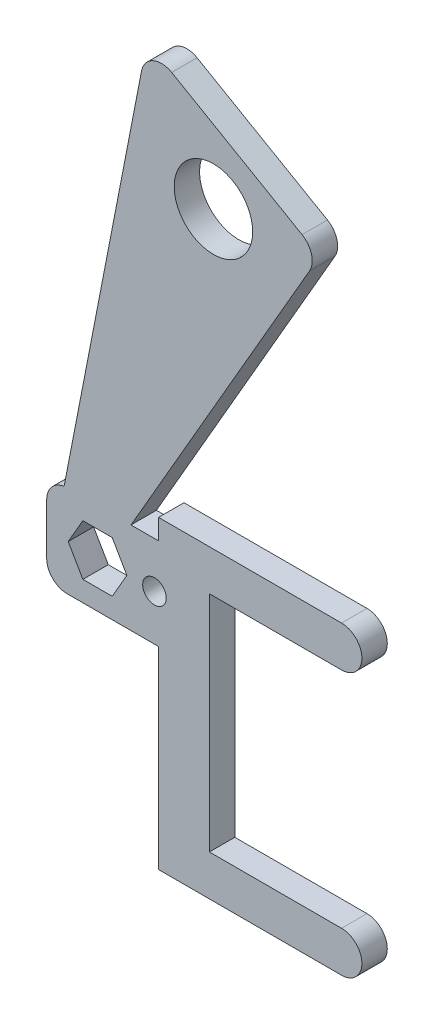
ISO-10303-21;
HEADER;
FILE_DESCRIPTION(('STEP AP214'),'2;1');
FILE_NAME('part.step','',(''),(''),'','','');
FILE_SCHEMA(('AUTOMOTIVE_DESIGN { 1 0 10303 214 1 1 1 1 }'));
ENDSEC;
DATA;
#1=APPLICATION_CONTEXT('core data for automotive mechanical design processes');
#2=APPLICATION_PROTOCOL_DEFINITION('international standard','automotive_design',2000,#1);
#3=PRODUCT_CONTEXT('',#1,'mechanical');
#4=PRODUCT('Part','Part','',(#3));
#5=PRODUCT_RELATED_PRODUCT_CATEGORY('part','',(#4));
#6=PRODUCT_DEFINITION_FORMATION('','',#4);
#7=PRODUCT_DEFINITION_CONTEXT('part definition',#1,'design');
#8=PRODUCT_DEFINITION('design','',#6,#7);
#9=PRODUCT_DEFINITION_SHAPE('','',#8);
#10=(LENGTH_UNIT() NAMED_UNIT(*) SI_UNIT(.MILLI.,.METRE.));
#11=(NAMED_UNIT(*) PLANE_ANGLE_UNIT() SI_UNIT($,.RADIAN.));
#12=(NAMED_UNIT(*) SI_UNIT($,.STERADIAN.) SOLID_ANGLE_UNIT());
#13=UNCERTAINTY_MEASURE_WITH_UNIT(LENGTH_MEASURE(1.E-05),#10,'distance_accuracy_value','');
#14=(GEOMETRIC_REPRESENTATION_CONTEXT(3) GLOBAL_UNCERTAINTY_ASSIGNED_CONTEXT((#13)) GLOBAL_UNIT_ASSIGNED_CONTEXT((#10,
#11,#12)) REPRESENTATION_CONTEXT('',''));
#15=CARTESIAN_POINT('',(0.,0.,0.));
#16=DIRECTION('',(0.,0.,1.));
#17=DIRECTION('',(1.,0.,0.));
#18=AXIS2_PLACEMENT_3D('',#15,#16,#17);
#19=CARTESIAN_POINT('',(0.,11.43,3.175));
#20=DIRECTION('',(0.,-1.,0.));
#21=DIRECTION('',(0.,0.,-1.));
#22=AXIS2_PLACEMENT_3D('',#19,#20,#21);
#23=PLANE('',#22);
#24=DIRECTION('',(0.,0.,-1.));
#25=VECTOR('',#24,1.);
#26=CARTESIAN_POINT('',(10.5271663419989,11.43,3.175));
#27=LINE('',#26,#25);
#28=CARTESIAN_POINT('',(10.5271663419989,11.43,3.175));
#29=VERTEX_POINT('',#28);
#30=CARTESIAN_POINT('',(10.5271663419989,11.43,0.));
#31=VERTEX_POINT('',#30);
#32=EDGE_CURVE('E280',#29,#31,#27,.T.);
#33=ORIENTED_EDGE('',*,*,#32,.F.);
#34=DIRECTION('',(-1.,0.,0.));
#35=VECTOR('',#34,1.);
#36=CARTESIAN_POINT('',(0.,11.43,3.175));
#37=LINE('',#36,#35);
#38=CARTESIAN_POINT('',(13.97,11.43,3.175));
#39=VERTEX_POINT('',#38);
#40=EDGE_CURVE('E297',#39,#29,#37,.T.);
#41=ORIENTED_EDGE('',*,*,#40,.F.);
#42=DIRECTION('',(0.,0.,-1.));
#43=VECTOR('',#42,1.);
#44=CARTESIAN_POINT('',(13.97,11.43,3.175));
#45=LINE('',#44,#43);
#46=CARTESIAN_POINT('',(13.97,11.43,0.));
#47=VERTEX_POINT('',#46);
#48=EDGE_CURVE('E371',#39,#47,#45,.T.);
#49=ORIENTED_EDGE('',*,*,#48,.T.);
#50=DIRECTION('',(-1.,0.,0.));
#51=VECTOR('',#50,1.);
#52=CARTESIAN_POINT('',(0.,11.43,0.));
#53=LINE('',#52,#51);
#54=EDGE_CURVE('E324',#47,#31,#53,.T.);
#55=ORIENTED_EDGE('',*,*,#54,.T.);
#56=EDGE_LOOP('',(#33,#41,#49,#55));
#57=FACE_BOUND('',#56,.T.);
#58=ADVANCED_FACE('F33',(#57),#23,.F.);
#59=CARTESIAN_POINT('',(13.97,11.43,3.175));
#60=DIRECTION('',(1.,0.,0.));
#61=DIRECTION('',(0.,0.,-1.));
#62=AXIS2_PLACEMENT_3D('',#59,#60,#61);
#63=PLANE('',#62);
#64=DIRECTION('',(0.,-1.,0.));
#65=VECTOR('',#64,1.);
#66=CARTESIAN_POINT('',(13.97,11.43,0.));
#67=LINE('',#66,#65);
#68=CARTESIAN_POINT('',(13.97,13.97,0.));
#69=VERTEX_POINT('',#68);
#70=EDGE_CURVE('E293',#69,#47,#67,.T.);
#71=ORIENTED_EDGE('',*,*,#70,.T.);
#72=ORIENTED_EDGE('',*,*,#48,.F.);
#73=DIRECTION('',(0.,-1.,0.));
#74=VECTOR('',#73,1.);
#75=CARTESIAN_POINT('',(13.97,11.43,3.175));
#76=LINE('',#75,#74);
#77=CARTESIAN_POINT('',(13.97,13.97,3.175));
#78=VERTEX_POINT('',#77);
#79=EDGE_CURVE('E294',#78,#39,#76,.T.);
#80=ORIENTED_EDGE('',*,*,#79,.F.);
#81=DIRECTION('',(0.,0.,-1.));
#82=VECTOR('',#81,1.);
#83=CARTESIAN_POINT('',(13.97,13.97,3.175));
#84=LINE('',#83,#82);
#85=EDGE_CURVE('E321',#78,#69,#84,.T.);
#86=ORIENTED_EDGE('',*,*,#85,.T.);
#87=EDGE_LOOP('',(#71,#72,#80,#86));
#88=FACE_BOUND('',#87,.T.);
#89=ADVANCED_FACE('F462',(#88),#63,.F.);
#90=CARTESIAN_POINT('',(0.,11.43,3.175));
#91=DIRECTION('',(1.,0.,0.));
#92=DIRECTION('',(0.,1.,0.));
#93=AXIS2_PLACEMENT_3D('',#90,#91,#92);
#94=PLANE('',#93);
#95=DIRECTION('',(0.,-1.,0.));
#96=VECTOR('',#95,1.);
#97=CARTESIAN_POINT('',(0.,11.43,0.));
#98=LINE('',#97,#96);
#99=CARTESIAN_POINT('',(0.,8.91667772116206,0.));
#100=VERTEX_POINT('',#99);
#101=CARTESIAN_POINT('',(0.,2.54,0.));
#102=VERTEX_POINT('',#101);
#103=EDGE_CURVE('E326',#100,#102,#98,.T.);
#104=ORIENTED_EDGE('',*,*,#103,.T.);
#105=DIRECTION('',(0.,0.,-1.));
#106=VECTOR('',#105,1.);
#107=CARTESIAN_POINT('',(0.,2.54,3.175));
#108=LINE('',#107,#106);
#109=CARTESIAN_POINT('',(0.,2.54,3.175));
#110=VERTEX_POINT('',#109);
#111=EDGE_CURVE('E48',#102,#110,#108,.F.);
#112=ORIENTED_EDGE('',*,*,#111,.T.);
#113=DIRECTION('',(0.,-1.,0.));
#114=VECTOR('',#113,1.);
#115=CARTESIAN_POINT('',(0.,11.43,3.175));
#116=LINE('',#115,#114);
#117=CARTESIAN_POINT('',(0.,8.91667772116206,3.175));
#118=VERTEX_POINT('',#117);
#119=EDGE_CURVE('E301',#118,#110,#116,.T.);
#120=ORIENTED_EDGE('',*,*,#119,.F.);
#121=DIRECTION('',(0.,0.,1.));
#122=VECTOR('',#121,1.);
#123=CARTESIAN_POINT('',(0.,8.91667772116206,3.175));
#124=LINE('',#123,#122);
#125=EDGE_CURVE('E399',#118,#100,#124,.F.);
#126=ORIENTED_EDGE('',*,*,#125,.T.);
#127=EDGE_LOOP('',(#104,#112,#120,#126));
#128=FACE_BOUND('',#127,.T.);
#129=ADVANCED_FACE('F404',(#128),#94,.F.);
#130=CARTESIAN_POINT('',(13.97,0.,3.175));
#131=DIRECTION('',(0.,1.,0.));
#132=DIRECTION('',(-1.,0.,0.));
#133=AXIS2_PLACEMENT_3D('',#130,#131,#132);
#134=PLANE('',#133);
#135=DIRECTION('',(1.,0.,0.));
#136=VECTOR('',#135,1.);
#137=CARTESIAN_POINT('',(13.97,0.,3.175));
#138=LINE('',#137,#136);
#139=CARTESIAN_POINT('',(2.54,0.,3.175));
#140=VERTEX_POINT('',#139);
#141=CARTESIAN_POINT('',(13.97,0.,3.175));
#142=VERTEX_POINT('',#141);
#143=EDGE_CURVE('E303',#140,#142,#138,.T.);
#144=ORIENTED_EDGE('',*,*,#143,.F.);
#145=DIRECTION('',(0.,0.,-1.));
#146=VECTOR('',#145,1.);
#147=CARTESIAN_POINT('',(2.54,0.,3.175));
#148=LINE('',#147,#146);
#149=CARTESIAN_POINT('',(2.54,0.,0.));
#150=VERTEX_POINT('',#149);
#151=EDGE_CURVE('E392',#140,#150,#148,.T.);
#152=ORIENTED_EDGE('',*,*,#151,.T.);
#153=DIRECTION('',(1.,0.,0.));
#154=VECTOR('',#153,1.);
#155=CARTESIAN_POINT('',(13.97,0.,0.));
#156=LINE('',#155,#154);
#157=CARTESIAN_POINT('',(13.97,0.,0.));
#158=VERTEX_POINT('',#157);
#159=EDGE_CURVE('E328',#150,#158,#156,.T.);
#160=ORIENTED_EDGE('',*,*,#159,.T.);
#161=DIRECTION('',(0.,0.,-1.));
#162=VECTOR('',#161,1.);
#163=CARTESIAN_POINT('',(13.97,0.,3.175));
#164=LINE('',#163,#162);
#165=EDGE_CURVE('E368',#142,#158,#164,.T.);
#166=ORIENTED_EDGE('',*,*,#165,.F.);
#167=EDGE_LOOP('',(#144,#152,#160,#166));
#168=FACE_BOUND('',#167,.T.);
#169=ADVANCED_FACE('F416',(#168),#134,.F.);
#170=CARTESIAN_POINT('',(13.97,-24.13,3.175));
#171=DIRECTION('',(1.,0.,0.));
#172=DIRECTION('',(0.,0.,-1.));
#173=AXIS2_PLACEMENT_3D('',#170,#171,#172);
#174=PLANE('',#173);
#175=DIRECTION('',(0.,-1.,0.));
#176=VECTOR('',#175,1.);
#177=CARTESIAN_POINT('',(13.97,-24.13,0.));
#178=LINE('',#177,#176);
#179=CARTESIAN_POINT('',(13.97,-24.13,0.));
#180=VERTEX_POINT('',#179);
#181=EDGE_CURVE('E330',#158,#180,#178,.T.);
#182=ORIENTED_EDGE('',*,*,#181,.T.);
#183=DIRECTION('',(0.,0.,-1.));
#184=VECTOR('',#183,1.);
#185=CARTESIAN_POINT('',(13.97,-24.13,3.175));
#186=LINE('',#185,#184);
#187=CARTESIAN_POINT('',(13.97,-24.13,3.175));
#188=VERTEX_POINT('',#187);
#189=EDGE_CURVE('E365',#188,#180,#186,.T.);
#190=ORIENTED_EDGE('',*,*,#189,.F.);
#191=DIRECTION('',(0.,-1.,0.));
#192=VECTOR('',#191,1.);
#193=CARTESIAN_POINT('',(13.97,-24.13,3.175));
#194=LINE('',#193,#192);
#195=EDGE_CURVE('E305',#142,#188,#194,.T.);
#196=ORIENTED_EDGE('',*,*,#195,.F.);
#197=ORIENTED_EDGE('',*,*,#165,.T.);
#198=EDGE_LOOP('',(#182,#190,#196,#197));
#199=FACE_BOUND('',#198,.T.);
#200=ADVANCED_FACE('F424',(#199),#174,.F.);
#201=CARTESIAN_POINT('',(13.97,-24.13,3.175));
#202=DIRECTION('',(0.,1.,0.));
#203=DIRECTION('',(0.,0.,1.));
#204=AXIS2_PLACEMENT_3D('',#201,#202,#203);
#205=PLANE('',#204);
#206=DIRECTION('',(1.,0.,0.));
#207=VECTOR('',#206,1.);
#208=CARTESIAN_POINT('',(13.97,-24.13,0.));
#209=LINE('',#208,#207);
#210=CARTESIAN_POINT('',(36.83,-24.13,0.));
#211=VERTEX_POINT('',#210);
#212=EDGE_CURVE('E332',#180,#211,#209,.T.);
#213=ORIENTED_EDGE('',*,*,#212,.T.);
#214=DIRECTION('',(0.,0.,-1.));
#215=VECTOR('',#214,1.);
#216=CARTESIAN_POINT('',(36.83,-24.13,3.175));
#217=LINE('',#216,#215);
#218=CARTESIAN_POINT('',(36.83,-24.13,3.175));
#219=VERTEX_POINT('',#218);
#220=EDGE_CURVE('E362',#219,#211,#217,.T.);
#221=ORIENTED_EDGE('',*,*,#220,.F.);
#222=DIRECTION('',(1.,0.,0.));
#223=VECTOR('',#222,1.);
#224=CARTESIAN_POINT('',(13.97,-24.13,3.175));
#225=LINE('',#224,#223);
#226=EDGE_CURVE('E307',#188,#219,#225,.T.);
#227=ORIENTED_EDGE('',*,*,#226,.F.);
#228=ORIENTED_EDGE('',*,*,#189,.T.);
#229=EDGE_LOOP('',(#213,#221,#227,#228));
#230=FACE_BOUND('',#229,.T.);
#231=ADVANCED_FACE('F427',(#230),#205,.F.);
#232=CARTESIAN_POINT('',(36.83,-21.59,3.175));
#233=DIRECTION('',(0.,0.,-1.));
#234=DIRECTION('',(-1.,0.,0.));
#235=AXIS2_PLACEMENT_3D('',#232,#233,#234);
#236=CYLINDRICAL_SURFACE('',#235,2.54);
#237=CARTESIAN_POINT('',(36.83,-21.59,0.));
#238=DIRECTION('',(0.,0.,1.));
#239=DIRECTION('',(-1.,0.,0.));
#240=AXIS2_PLACEMENT_3D('',#237,#238,#239);
#241=CIRCLE('',#240,2.54);
#242=CARTESIAN_POINT('',(36.83,-19.05,0.));
#243=VERTEX_POINT('',#242);
#244=EDGE_CURVE('E334',#211,#243,#241,.T.);
#245=ORIENTED_EDGE('',*,*,#244,.T.);
#246=DIRECTION('',(0.,0.,-1.));
#247=VECTOR('',#246,1.);
#248=CARTESIAN_POINT('',(36.83,-19.05,3.175));
#249=LINE('',#248,#247);
#250=CARTESIAN_POINT('',(36.83,-19.05,3.175));
#251=VERTEX_POINT('',#250);
#252=EDGE_CURVE('E359',#251,#243,#249,.T.);
#253=ORIENTED_EDGE('',*,*,#252,.F.);
#254=CARTESIAN_POINT('',(36.83,-21.59,3.175));
#255=DIRECTION('',(0.,0.,1.));
#256=DIRECTION('',(-1.,0.,0.));
#257=AXIS2_PLACEMENT_3D('',#254,#255,#256);
#258=CIRCLE('',#257,2.54);
#259=EDGE_CURVE('E309',#219,#251,#258,.T.);
#260=ORIENTED_EDGE('',*,*,#259,.F.);
#261=ORIENTED_EDGE('',*,*,#220,.T.);
#262=EDGE_LOOP('',(#245,#253,#260,#261));
#263=FACE_BOUND('',#262,.T.);
#264=ADVANCED_FACE('F432',(#263),#236,.T.);
#265=CARTESIAN_POINT('',(20.32,-19.05,3.175));
#266=DIRECTION('',(0.,-1.,0.));
#267=DIRECTION('',(0.,0.,-1.));
#268=AXIS2_PLACEMENT_3D('',#265,#266,#267);
#269=PLANE('',#268);
#270=DIRECTION('',(-1.,0.,0.));
#271=VECTOR('',#270,1.);
#272=CARTESIAN_POINT('',(20.32,-19.05,0.));
#273=LINE('',#272,#271);
#274=CARTESIAN_POINT('',(20.32,-19.05,0.));
#275=VERTEX_POINT('',#274);
#276=EDGE_CURVE('E336',#243,#275,#273,.T.);
#277=ORIENTED_EDGE('',*,*,#276,.T.);
#278=DIRECTION('',(0.,0.,-1.));
#279=VECTOR('',#278,1.);
#280=CARTESIAN_POINT('',(20.32,-19.05,3.175));
#281=LINE('',#280,#279);
#282=CARTESIAN_POINT('',(20.32,-19.05,3.175));
#283=VERTEX_POINT('',#282);
#284=EDGE_CURVE('E356',#283,#275,#281,.T.);
#285=ORIENTED_EDGE('',*,*,#284,.F.);
#286=DIRECTION('',(-1.,0.,0.));
#287=VECTOR('',#286,1.);
#288=CARTESIAN_POINT('',(20.32,-19.05,3.175));
#289=LINE('',#288,#287);
#290=EDGE_CURVE('E311',#251,#283,#289,.T.);
#291=ORIENTED_EDGE('',*,*,#290,.F.);
#292=ORIENTED_EDGE('',*,*,#252,.T.);
#293=EDGE_LOOP('',(#277,#285,#291,#292));
#294=FACE_BOUND('',#293,.T.);
#295=ADVANCED_FACE('F438',(#294),#269,.F.);
#296=CARTESIAN_POINT('',(20.32,8.89,3.175));
#297=DIRECTION('',(-1.,0.,0.));
#298=DIRECTION('',(0.,-1.,0.));
#299=AXIS2_PLACEMENT_3D('',#296,#297,#298);
#300=PLANE('',#299);
#301=DIRECTION('',(0.,1.,0.));
#302=VECTOR('',#301,1.);
#303=CARTESIAN_POINT('',(20.32,8.89,0.));
#304=LINE('',#303,#302);
#305=CARTESIAN_POINT('',(20.32,8.89,0.));
#306=VERTEX_POINT('',#305);
#307=EDGE_CURVE('E338',#275,#306,#304,.T.);
#308=ORIENTED_EDGE('',*,*,#307,.T.);
#309=DIRECTION('',(0.,0.,-1.));
#310=VECTOR('',#309,1.);
#311=CARTESIAN_POINT('',(20.32,8.89,3.175));
#312=LINE('',#311,#310);
#313=CARTESIAN_POINT('',(20.32,8.89,3.175));
#314=VERTEX_POINT('',#313);
#315=EDGE_CURVE('E353',#314,#306,#312,.T.);
#316=ORIENTED_EDGE('',*,*,#315,.F.);
#317=DIRECTION('',(0.,1.,0.));
#318=VECTOR('',#317,1.);
#319=CARTESIAN_POINT('',(20.32,8.89,3.175));
#320=LINE('',#319,#318);
#321=EDGE_CURVE('E313',#283,#314,#320,.T.);
#322=ORIENTED_EDGE('',*,*,#321,.F.);
#323=ORIENTED_EDGE('',*,*,#284,.T.);
#324=EDGE_LOOP('',(#308,#316,#322,#323));
#325=FACE_BOUND('',#324,.T.);
#326=ADVANCED_FACE('F442',(#325),#300,.F.);
#327=CARTESIAN_POINT('',(20.32,8.89,3.175));
#328=DIRECTION('',(0.,1.,0.));
#329=DIRECTION('',(0.,0.,1.));
#330=AXIS2_PLACEMENT_3D('',#327,#328,#329);
#331=PLANE('',#330);
#332=DIRECTION('',(1.,0.,0.));
#333=VECTOR('',#332,1.);
#334=CARTESIAN_POINT('',(20.32,8.89,0.));
#335=LINE('',#334,#333);
#336=CARTESIAN_POINT('',(36.83,8.89,0.));
#337=VERTEX_POINT('',#336);
#338=EDGE_CURVE('E340',#306,#337,#335,.T.);
#339=ORIENTED_EDGE('',*,*,#338,.T.);
#340=DIRECTION('',(0.,0.,-1.));
#341=VECTOR('',#340,1.);
#342=CARTESIAN_POINT('',(36.83,8.89,3.175));
#343=LINE('',#342,#341);
#344=CARTESIAN_POINT('',(36.83,8.89,3.175));
#345=VERTEX_POINT('',#344);
#346=EDGE_CURVE('E350',#345,#337,#343,.T.);
#347=ORIENTED_EDGE('',*,*,#346,.F.);
#348=DIRECTION('',(1.,0.,0.));
#349=VECTOR('',#348,1.);
#350=CARTESIAN_POINT('',(20.32,8.89,3.175));
#351=LINE('',#350,#349);
#352=EDGE_CURVE('E315',#314,#345,#351,.T.);
#353=ORIENTED_EDGE('',*,*,#352,.F.);
#354=ORIENTED_EDGE('',*,*,#315,.T.);
#355=EDGE_LOOP('',(#339,#347,#353,#354));
#356=FACE_BOUND('',#355,.T.);
#357=ADVANCED_FACE('F447',(#356),#331,.F.);
#358=CARTESIAN_POINT('',(36.83,11.43,3.175));
#359=DIRECTION('',(0.,0.,-1.));
#360=DIRECTION('',(-1.,0.,0.));
#361=AXIS2_PLACEMENT_3D('',#358,#359,#360);
#362=CYLINDRICAL_SURFACE('',#361,2.54);
#363=CARTESIAN_POINT('',(36.83,11.43,0.));
#364=DIRECTION('',(0.,0.,1.));
#365=DIRECTION('',(1.,0.,0.));
#366=AXIS2_PLACEMENT_3D('',#363,#364,#365);
#367=CIRCLE('',#366,2.54);
#368=CARTESIAN_POINT('',(36.83,13.97,0.));
#369=VERTEX_POINT('',#368);
#370=EDGE_CURVE('E342',#337,#369,#367,.T.);
#371=ORIENTED_EDGE('',*,*,#370,.T.);
#372=DIRECTION('',(0.,0.,-1.));
#373=VECTOR('',#372,1.);
#374=CARTESIAN_POINT('',(36.83,13.97,3.175));
#375=LINE('',#374,#373);
#376=CARTESIAN_POINT('',(36.83,13.97,3.175));
#377=VERTEX_POINT('',#376);
#378=EDGE_CURVE('E347',#377,#369,#375,.T.);
#379=ORIENTED_EDGE('',*,*,#378,.F.);
#380=CARTESIAN_POINT('',(36.83,11.43,3.175));
#381=DIRECTION('',(0.,0.,1.));
#382=DIRECTION('',(1.,0.,0.));
#383=AXIS2_PLACEMENT_3D('',#380,#381,#382);
#384=CIRCLE('',#383,2.54);
#385=EDGE_CURVE('E317',#345,#377,#384,.T.);
#386=ORIENTED_EDGE('',*,*,#385,.F.);
#387=ORIENTED_EDGE('',*,*,#346,.T.);
#388=EDGE_LOOP('',(#371,#379,#386,#387));
#389=FACE_BOUND('',#388,.T.);
#390=ADVANCED_FACE('F453',(#389),#362,.T.);
#391=CARTESIAN_POINT('',(36.83,13.97,3.175));
#392=DIRECTION('',(0.,-1.,0.));
#393=DIRECTION('',(1.,0.,0.));
#394=AXIS2_PLACEMENT_3D('',#391,#392,#393);
#395=PLANE('',#394);
#396=DIRECTION('',(-1.,0.,0.));
#397=VECTOR('',#396,1.);
#398=CARTESIAN_POINT('',(36.83,13.97,0.));
#399=LINE('',#398,#397);
#400=EDGE_CURVE('E298',#369,#69,#399,.T.);
#401=ORIENTED_EDGE('',*,*,#400,.T.);
#402=ORIENTED_EDGE('',*,*,#85,.F.);
#403=DIRECTION('',(-1.,0.,0.));
#404=VECTOR('',#403,1.);
#405=CARTESIAN_POINT('',(36.83,13.97,3.175));
#406=LINE('',#405,#404);
#407=EDGE_CURVE('E319',#377,#78,#406,.T.);
#408=ORIENTED_EDGE('',*,*,#407,.F.);
#409=ORIENTED_EDGE('',*,*,#378,.T.);
#410=EDGE_LOOP('',(#401,#402,#408,#409));
#411=FACE_BOUND('',#410,.T.);
#412=ADVANCED_FACE('F457',(#411),#395,.F.);
#413=CARTESIAN_POINT('',(36.83,11.43,3.175));
#414=DIRECTION('',(0.,0.,1.));
#415=DIRECTION('',(1.,0.,0.));
#416=AXIS2_PLACEMENT_3D('',#413,#414,#415);
#417=PLANE('',#416);
#418=DIRECTION('',(-0.5,0.866025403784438,0.));
#419=VECTOR('',#418,1.);
#420=CARTESIAN_POINT('',(10.0161742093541,5.715,3.175));
#421=LINE('',#420,#419);
#422=CARTESIAN_POINT('',(10.0161742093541,5.715,3.175));
#423=VERTEX_POINT('',#422);
#424=CARTESIAN_POINT('',(8.18308710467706,8.89,3.175));
#425=VERTEX_POINT('',#424);
#426=EDGE_CURVE('E206',#423,#425,#421,.T.);
#427=ORIENTED_EDGE('',*,*,#426,.F.);
#428=DIRECTION('',(0.499999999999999,0.866025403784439,0.));
#429=VECTOR('',#428,1.);
#430=CARTESIAN_POINT('',(8.18308710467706,2.54,3.175));
#431=LINE('',#430,#429);
#432=CARTESIAN_POINT('',(8.18308710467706,2.54,3.175));
#433=VERTEX_POINT('',#432);
#434=EDGE_CURVE('E225',#433,#423,#431,.T.);
#435=ORIENTED_EDGE('',*,*,#434,.F.);
#436=DIRECTION('',(1.,0.,0.));
#437=VECTOR('',#436,1.);
#438=CARTESIAN_POINT('',(4.51691289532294,2.54,3.175));
#439=LINE('',#438,#437);
#440=CARTESIAN_POINT('',(4.51691289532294,2.54,3.175));
#441=VERTEX_POINT('',#440);
#442=EDGE_CURVE('E228',#441,#433,#439,.T.);
#443=ORIENTED_EDGE('',*,*,#442,.F.);
#444=DIRECTION('',(0.5,-0.866025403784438,0.));
#445=VECTOR('',#444,1.);
#446=CARTESIAN_POINT('',(2.68382579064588,5.715,3.175));
#447=LINE('',#446,#445);
#448=CARTESIAN_POINT('',(2.68382579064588,5.715,3.175));
#449=VERTEX_POINT('',#448);
#450=EDGE_CURVE('E244',#449,#441,#447,.T.);
#451=ORIENTED_EDGE('',*,*,#450,.F.);
#452=DIRECTION('',(-0.499999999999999,-0.866025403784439,0.));
#453=VECTOR('',#452,1.);
#454=CARTESIAN_POINT('',(4.51691289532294,8.89,3.175));
#455=LINE('',#454,#453);
#456=CARTESIAN_POINT('',(4.51691289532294,8.89,3.175));
#457=VERTEX_POINT('',#456);
#458=EDGE_CURVE('E241',#457,#449,#455,.T.);
#459=ORIENTED_EDGE('',*,*,#458,.F.);
#460=DIRECTION('',(-1.,0.,0.));
#461=VECTOR('',#460,1.);
#462=CARTESIAN_POINT('',(8.18308710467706,8.89,3.175));
#463=LINE('',#462,#461);
#464=EDGE_CURVE('E239',#425,#457,#463,.T.);
#465=ORIENTED_EDGE('',*,*,#464,.F.);
#466=EDGE_LOOP('',(#427,#435,#443,#451,#459,#465));
#467=FACE_BOUND('',#466,.T.);
#468=CARTESIAN_POINT('',(20.8267595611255,50.7472689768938,3.175));
#469=DIRECTION('',(0.,0.,1.));
#470=DIRECTION('',(1.,0.,0.));
#471=AXIS2_PLACEMENT_3D('',#468,#469,#470);
#472=CIRCLE('',#471,4.90219999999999);
#473=CARTESIAN_POINT('',(25.7289595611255,50.7472689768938,3.175));
#474=VERTEX_POINT('',#473);
#475=EDGE_CURVE('E251',#474,#474,#472,.T.);
#476=ORIENTED_EDGE('',*,*,#475,.F.);
#477=EDGE_LOOP('',(#476));
#478=FACE_BOUND('',#477,.T.);
#479=CARTESIAN_POINT('',(13.462,5.715,3.175));
#480=DIRECTION('',(0.,0.,1.));
#481=DIRECTION('',(1.,0.,0.));
#482=AXIS2_PLACEMENT_3D('',#479,#480,#481);
#483=CIRCLE('',#482,1.47319999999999);
#484=CARTESIAN_POINT('',(14.9352,5.715,3.175));
#485=VERTEX_POINT('',#484);
#486=EDGE_CURVE('E264',#485,#485,#483,.T.);
#487=ORIENTED_EDGE('',*,*,#486,.F.);
#488=EDGE_LOOP('',(#487));
#489=FACE_BOUND('',#488,.T.);
#490=ORIENTED_EDGE('',*,*,#119,.T.);
#491=CARTESIAN_POINT('',(2.54,2.54,3.175));
#492=DIRECTION('',(0.,0.,1.));
#493=DIRECTION('',(1.,0.,0.));
#494=AXIS2_PLACEMENT_3D('',#491,#492,#493);
#495=CIRCLE('',#494,2.54);
#496=EDGE_CURVE('E11',#110,#140,#495,.T.);
#497=ORIENTED_EDGE('',*,*,#496,.T.);
#498=ORIENTED_EDGE('',*,*,#143,.T.);
#499=ORIENTED_EDGE('',*,*,#195,.T.);
#500=ORIENTED_EDGE('',*,*,#226,.T.);
#501=ORIENTED_EDGE('',*,*,#259,.T.);
#502=ORIENTED_EDGE('',*,*,#290,.T.);
#503=ORIENTED_EDGE('',*,*,#321,.T.);
#504=ORIENTED_EDGE('',*,*,#352,.T.);
#505=ORIENTED_EDGE('',*,*,#385,.T.);
#506=ORIENTED_EDGE('',*,*,#407,.T.);
#507=ORIENTED_EDGE('',*,*,#79,.T.);
#508=ORIENTED_EDGE('',*,*,#40,.T.);
#509=DIRECTION('',(0.499999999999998,0.86602540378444,0.));
#510=VECTOR('',#509,1.);
#511=CARTESIAN_POINT('',(10.5271663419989,11.43,3.175));
#512=LINE('',#511,#510);
#513=CARTESIAN_POINT('',(32.8256915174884,50.0521785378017,3.175));
#514=VERTEX_POINT('',#513);
#515=EDGE_CURVE('E273',#29,#514,#512,.T.);
#516=ORIENTED_EDGE('',*,*,#515,.T.);
#517=CARTESIAN_POINT('',(30.6259869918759,51.3221785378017,3.175));
#518=DIRECTION('',(0.,0.,1.));
#519=DIRECTION('',(1.,0.,0.));
#520=AXIS2_PLACEMENT_3D('',#517,#518,#519);
#521=CIRCLE('',#520,2.54);
#522=CARTESIAN_POINT('',(31.8959869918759,53.5218830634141,3.175));
#523=VERTEX_POINT('',#522);
#524=EDGE_CURVE('E387',#514,#523,#521,.T.);
#525=ORIENTED_EDGE('',*,*,#524,.T.);
#526=DIRECTION('',(-0.866025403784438,0.500000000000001,0.));
#527=VECTOR('',#526,1.);
#528=CARTESIAN_POINT('',(12.5282242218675,64.7038661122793,3.175));
#529=LINE('',#528,#527);
#530=CARTESIAN_POINT('',(15.6120962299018,62.9233917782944,3.175));
#531=VERTEX_POINT('',#530);
#532=EDGE_CURVE('E277',#523,#531,#529,.T.);
#533=ORIENTED_EDGE('',*,*,#532,.T.);
#534=CARTESIAN_POINT('',(14.3420962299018,60.7236872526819,3.175));
#535=DIRECTION('',(0.,0.,1.));
#536=DIRECTION('',(1.,0.,0.));
#537=AXIS2_PLACEMENT_3D('',#534,#535,#536);
#538=CIRCLE('',#537,2.54);
#539=CARTESIAN_POINT('',(11.8487631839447,61.2083421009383,3.175));
#540=VERTEX_POINT('',#539);
#541=EDGE_CURVE('E385',#531,#540,#538,.T.);
#542=ORIENTED_EDGE('',*,*,#541,.T.);
#543=DIRECTION('',(-0.190808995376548,-0.981627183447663,0.));
#544=VECTOR('',#543,1.);
#545=CARTESIAN_POINT('',(2.17283365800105,11.43,3.175));
#546=LINE('',#545,#544);
#547=CARTESIAN_POINT('',(2.17283365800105,11.43,3.175));
#548=VERTEX_POINT('',#547);
#549=EDGE_CURVE('E271',#540,#548,#546,.T.);
#550=ORIENTED_EDGE('',*,*,#549,.T.);
#551=CARTESIAN_POINT('',(2.54,8.91667772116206,3.175));
#552=DIRECTION('',(0.,0.,1.));
#553=DIRECTION('',(1.,0.,0.));
#554=AXIS2_PLACEMENT_3D('',#551,#552,#553);
#555=CIRCLE('',#554,2.54);
#556=EDGE_CURVE('E41',#548,#118,#555,.T.);
#557=ORIENTED_EDGE('',*,*,#556,.T.);
#558=EDGE_LOOP('',(#490,#497,#498,#499,#500,#501,#502,#503,#504,#505,#506,#507,#508,#516,#525,
#533,#542,#550,#557));
#559=FACE_BOUND('',#558,.T.);
#560=ADVANCED_FACE('F419',(#467,#478,#489,#559),#417,.T.);
#561=CARTESIAN_POINT('',(36.83,11.43,0.));
#562=DIRECTION('',(0.,0.,1.));
#563=DIRECTION('',(1.,0.,0.));
#564=AXIS2_PLACEMENT_3D('',#561,#562,#563);
#565=PLANE('',#564);
#566=DIRECTION('',(0.499999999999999,0.866025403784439,0.));
#567=VECTOR('',#566,1.);
#568=CARTESIAN_POINT('',(8.18308710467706,2.54,0.));
#569=LINE('',#568,#567);
#570=CARTESIAN_POINT('',(8.18308710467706,2.54,0.));
#571=VERTEX_POINT('',#570);
#572=CARTESIAN_POINT('',(10.0161742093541,5.715,0.));
#573=VERTEX_POINT('',#572);
#574=EDGE_CURVE('E211',#571,#573,#569,.T.);
#575=ORIENTED_EDGE('',*,*,#574,.T.);
#576=DIRECTION('',(-0.5,0.866025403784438,0.));
#577=VECTOR('',#576,1.);
#578=CARTESIAN_POINT('',(10.0161742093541,5.715,0.));
#579=LINE('',#578,#577);
#580=CARTESIAN_POINT('',(8.18308710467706,8.89,0.));
#581=VERTEX_POINT('',#580);
#582=EDGE_CURVE('E203',#573,#581,#579,.T.);
#583=ORIENTED_EDGE('',*,*,#582,.T.);
#584=DIRECTION('',(-1.,0.,0.));
#585=VECTOR('',#584,1.);
#586=CARTESIAN_POINT('',(8.18308710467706,8.89,0.));
#587=LINE('',#586,#585);
#588=CARTESIAN_POINT('',(4.51691289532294,8.89,0.));
#589=VERTEX_POINT('',#588);
#590=EDGE_CURVE('E215',#581,#589,#587,.T.);
#591=ORIENTED_EDGE('',*,*,#590,.T.);
#592=DIRECTION('',(-0.499999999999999,-0.866025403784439,0.));
#593=VECTOR('',#592,1.);
#594=CARTESIAN_POINT('',(4.51691289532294,8.89,0.));
#595=LINE('',#594,#593);
#596=CARTESIAN_POINT('',(2.68382579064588,5.715,0.));
#597=VERTEX_POINT('',#596);
#598=EDGE_CURVE('E219',#589,#597,#595,.T.);
#599=ORIENTED_EDGE('',*,*,#598,.T.);
#600=DIRECTION('',(0.5,-0.866025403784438,0.));
#601=VECTOR('',#600,1.);
#602=CARTESIAN_POINT('',(2.68382579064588,5.715,0.));
#603=LINE('',#602,#601);
#604=CARTESIAN_POINT('',(4.51691289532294,2.54,0.));
#605=VERTEX_POINT('',#604);
#606=EDGE_CURVE('E232',#597,#605,#603,.T.);
#607=ORIENTED_EDGE('',*,*,#606,.T.);
#608=DIRECTION('',(1.,0.,0.));
#609=VECTOR('',#608,1.);
#610=CARTESIAN_POINT('',(4.51691289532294,2.54,0.));
#611=LINE('',#610,#609);
#612=EDGE_CURVE('E235',#605,#571,#611,.T.);
#613=ORIENTED_EDGE('',*,*,#612,.T.);
#614=EDGE_LOOP('',(#575,#583,#591,#599,#607,#613));
#615=FACE_BOUND('',#614,.T.);
#616=CARTESIAN_POINT('',(20.8267595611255,50.7472689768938,0.));
#617=DIRECTION('',(0.,0.,1.));
#618=DIRECTION('',(1.,0.,0.));
#619=AXIS2_PLACEMENT_3D('',#616,#617,#618);
#620=CIRCLE('',#619,4.9022);
#621=CARTESIAN_POINT('',(25.7289595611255,50.7472689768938,0.));
#622=VERTEX_POINT('',#621);
#623=EDGE_CURVE('E261',#622,#622,#620,.T.);
#624=ORIENTED_EDGE('',*,*,#623,.T.);
#625=EDGE_LOOP('',(#624));
#626=FACE_BOUND('',#625,.T.);
#627=CARTESIAN_POINT('',(13.462,5.715,0.));
#628=DIRECTION('',(0.,0.,1.));
#629=DIRECTION('',(1.,0.,0.));
#630=AXIS2_PLACEMENT_3D('',#627,#628,#629);
#631=CIRCLE('',#630,1.4732);
#632=CARTESIAN_POINT('',(14.9352,5.715,0.));
#633=VERTEX_POINT('',#632);
#634=EDGE_CURVE('E267',#633,#633,#631,.T.);
#635=ORIENTED_EDGE('',*,*,#634,.T.);
#636=EDGE_LOOP('',(#635));
#637=FACE_BOUND('',#636,.T.);
#638=ORIENTED_EDGE('',*,*,#159,.F.);
#639=CARTESIAN_POINT('',(2.54,2.54,0.));
#640=DIRECTION('',(0.,0.,1.));
#641=DIRECTION('',(1.,0.,0.));
#642=AXIS2_PLACEMENT_3D('',#639,#640,#641);
#643=CIRCLE('',#642,2.54);
#644=EDGE_CURVE('E397',#150,#102,#643,.F.);
#645=ORIENTED_EDGE('',*,*,#644,.T.);
#646=ORIENTED_EDGE('',*,*,#103,.F.);
#647=CARTESIAN_POINT('',(2.54,8.91667772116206,0.));
#648=DIRECTION('',(0.,0.,1.));
#649=DIRECTION('',(1.,0.,0.));
#650=AXIS2_PLACEMENT_3D('',#647,#648,#649);
#651=CIRCLE('',#650,2.54);
#652=CARTESIAN_POINT('',(2.17283365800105,11.43,0.));
#653=VERTEX_POINT('',#652);
#654=EDGE_CURVE('E395',#100,#653,#651,.F.);
#655=ORIENTED_EDGE('',*,*,#654,.T.);
#656=DIRECTION('',(-0.190808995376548,-0.981627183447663,0.));
#657=VECTOR('',#656,1.);
#658=CARTESIAN_POINT('',(2.17283365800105,11.43,0.));
#659=LINE('',#658,#657);
#660=CARTESIAN_POINT('',(11.8487631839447,61.2083421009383,0.));
#661=VERTEX_POINT('',#660);
#662=EDGE_CURVE('E270',#661,#653,#659,.T.);
#663=ORIENTED_EDGE('',*,*,#662,.F.);
#664=CARTESIAN_POINT('',(14.3420962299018,60.7236872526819,0.));
#665=DIRECTION('',(0.,0.,1.));
#666=DIRECTION('',(1.,0.,0.));
#667=AXIS2_PLACEMENT_3D('',#664,#665,#666);
#668=CIRCLE('',#667,2.54);
#669=CARTESIAN_POINT('',(15.6120962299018,62.9233917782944,0.));
#670=VERTEX_POINT('',#669);
#671=EDGE_CURVE('E379',#661,#670,#668,.F.);
#672=ORIENTED_EDGE('',*,*,#671,.T.);
#673=DIRECTION('',(-0.866025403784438,0.500000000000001,0.));
#674=VECTOR('',#673,1.);
#675=CARTESIAN_POINT('',(12.5282242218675,64.7038661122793,0.));
#676=LINE('',#675,#674);
#677=CARTESIAN_POINT('',(31.8959869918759,53.5218830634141,0.));
#678=VERTEX_POINT('',#677);
#679=EDGE_CURVE('E274',#678,#670,#676,.T.);
#680=ORIENTED_EDGE('',*,*,#679,.F.);
#681=CARTESIAN_POINT('',(30.6259869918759,51.3221785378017,0.));
#682=DIRECTION('',(0.,0.,1.));
#683=DIRECTION('',(1.,0.,0.));
#684=AXIS2_PLACEMENT_3D('',#681,#682,#683);
#685=CIRCLE('',#684,2.54);
#686=CARTESIAN_POINT('',(32.8256915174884,50.0521785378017,0.));
#687=VERTEX_POINT('',#686);
#688=EDGE_CURVE('E381',#678,#687,#685,.F.);
#689=ORIENTED_EDGE('',*,*,#688,.T.);
#690=DIRECTION('',(0.499999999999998,0.86602540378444,0.));
#691=VECTOR('',#690,1.);
#692=CARTESIAN_POINT('',(10.5271663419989,11.43,0.));
#693=LINE('',#692,#691);
#694=EDGE_CURVE('E283',#31,#687,#693,.T.);
#695=ORIENTED_EDGE('',*,*,#694,.F.);
#696=ORIENTED_EDGE('',*,*,#54,.F.);
#697=ORIENTED_EDGE('',*,*,#70,.F.);
#698=ORIENTED_EDGE('',*,*,#400,.F.);
#699=ORIENTED_EDGE('',*,*,#370,.F.);
#700=ORIENTED_EDGE('',*,*,#338,.F.);
#701=ORIENTED_EDGE('',*,*,#307,.F.);
#702=ORIENTED_EDGE('',*,*,#276,.F.);
#703=ORIENTED_EDGE('',*,*,#244,.F.);
#704=ORIENTED_EDGE('',*,*,#212,.F.);
#705=ORIENTED_EDGE('',*,*,#181,.F.);
#706=EDGE_LOOP('',(#638,#645,#646,#655,#663,#672,#680,#689,#695,#696,#697,#698,#699,#700,#701,
#702,#703,#704,#705));
#707=FACE_BOUND('',#706,.T.);
#708=ADVANCED_FACE('F221',(#615,#626,#637,#707),#565,.F.);
#709=CARTESIAN_POINT('',(2.17283365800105,11.43,3.175));
#710=DIRECTION('',(0.981627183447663,-0.190808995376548,0.));
#711=DIRECTION('',(0.190808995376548,0.981627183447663,0.));
#712=AXIS2_PLACEMENT_3D('',#709,#710,#711);
#713=PLANE('',#712);
#714=ORIENTED_EDGE('',*,*,#549,.F.);
#715=DIRECTION('',(0.,0.,-1.));
#716=VECTOR('',#715,1.);
#717=CARTESIAN_POINT('',(11.8487631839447,61.2083421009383,3.175));
#718=LINE('',#717,#716);
#719=EDGE_CURVE('E389',#540,#661,#718,.T.);
#720=ORIENTED_EDGE('',*,*,#719,.T.);
#721=ORIENTED_EDGE('',*,*,#662,.T.);
#722=DIRECTION('',(0.,0.,-1.));
#723=VECTOR('',#722,1.);
#724=CARTESIAN_POINT('',(2.17283365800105,11.43,3.175));
#725=LINE('',#724,#723);
#726=EDGE_CURVE('E290',#548,#653,#725,.T.);
#727=ORIENTED_EDGE('',*,*,#726,.F.);
#728=EDGE_LOOP('',(#714,#720,#721,#727));
#729=FACE_BOUND('',#728,.T.);
#730=ADVANCED_FACE('F485',(#729),#713,.F.);
#731=CARTESIAN_POINT('',(10.5271663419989,11.43,3.175));
#732=DIRECTION('',(-0.86602540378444,0.499999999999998,0.));
#733=DIRECTION('',(-0.499999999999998,-0.86602540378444,0.));
#734=AXIS2_PLACEMENT_3D('',#731,#732,#733);
#735=PLANE('',#734);
#736=ORIENTED_EDGE('',*,*,#694,.T.);
#737=DIRECTION('',(0.,0.,-1.));
#738=VECTOR('',#737,1.);
#739=CARTESIAN_POINT('',(32.8256915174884,50.0521785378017,3.175));
#740=LINE('',#739,#738);
#741=EDGE_CURVE('E383',#687,#514,#740,.F.);
#742=ORIENTED_EDGE('',*,*,#741,.T.);
#743=ORIENTED_EDGE('',*,*,#515,.F.);
#744=ORIENTED_EDGE('',*,*,#32,.T.);
#745=EDGE_LOOP('',(#736,#742,#743,#744));
#746=FACE_BOUND('',#745,.T.);
#747=ADVANCED_FACE('F467',(#746),#735,.F.);
#748=CARTESIAN_POINT('',(12.5282242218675,64.7038661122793,3.175));
#749=DIRECTION('',(-0.500000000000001,-0.866025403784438,0.));
#750=DIRECTION('',(0.866025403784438,-0.500000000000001,0.));
#751=AXIS2_PLACEMENT_3D('',#748,#749,#750);
#752=PLANE('',#751);
#753=ORIENTED_EDGE('',*,*,#532,.F.);
#754=DIRECTION('',(0.,0.,-1.));
#755=VECTOR('',#754,1.);
#756=CARTESIAN_POINT('',(31.8959869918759,53.5218830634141,3.175));
#757=LINE('',#756,#755);
#758=EDGE_CURVE('E376',#523,#678,#757,.T.);
#759=ORIENTED_EDGE('',*,*,#758,.T.);
#760=ORIENTED_EDGE('',*,*,#679,.T.);
#761=DIRECTION('',(0.,0.,-1.));
#762=VECTOR('',#761,1.);
#763=CARTESIAN_POINT('',(15.6120962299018,62.9233917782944,3.175));
#764=LINE('',#763,#762);
#765=EDGE_CURVE('E374',#670,#531,#764,.F.);
#766=ORIENTED_EDGE('',*,*,#765,.T.);
#767=EDGE_LOOP('',(#753,#759,#760,#766));
#768=FACE_BOUND('',#767,.T.);
#769=ADVANCED_FACE('F476',(#768),#752,.F.);
#770=CARTESIAN_POINT('',(13.462,5.715,3.175));
#771=DIRECTION('',(0.,0.,1.));
#772=DIRECTION('',(1.,0.,0.));
#773=AXIS2_PLACEMENT_3D('',#770,#771,#772);
#774=CYLINDRICAL_SURFACE('',#773,1.47319999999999);
#775=ORIENTED_EDGE('',*,*,#634,.F.);
#776=EDGE_LOOP('',(#775));
#777=FACE_BOUND('',#776,.T.);
#778=ORIENTED_EDGE('',*,*,#486,.T.);
#779=EDGE_LOOP('',(#778));
#780=FACE_BOUND('',#779,.T.);
#781=ADVANCED_FACE('F637',(#777,#780),#774,.F.);
#782=CARTESIAN_POINT('',(20.8267595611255,50.7472689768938,3.175));
#783=DIRECTION('',(0.,0.,1.));
#784=DIRECTION('',(1.,0.,0.));
#785=AXIS2_PLACEMENT_3D('',#782,#783,#784);
#786=CYLINDRICAL_SURFACE('',#785,4.90219999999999);
#787=ORIENTED_EDGE('',*,*,#623,.F.);
#788=EDGE_LOOP('',(#787));
#789=FACE_BOUND('',#788,.T.);
#790=ORIENTED_EDGE('',*,*,#475,.T.);
#791=EDGE_LOOP('',(#790));
#792=FACE_BOUND('',#791,.T.);
#793=ADVANCED_FACE('F642',(#789,#792),#786,.F.);
#794=CARTESIAN_POINT('',(10.0161742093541,5.715,0.));
#795=DIRECTION('',(0.866025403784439,0.5,0.));
#796=DIRECTION('',(-0.5,0.866025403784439,0.));
#797=AXIS2_PLACEMENT_3D('',#794,#795,#796);
#798=PLANE('',#797);
#799=ORIENTED_EDGE('',*,*,#426,.T.);
#800=DIRECTION('',(0.,0.,1.));
#801=VECTOR('',#800,1.);
#802=CARTESIAN_POINT('',(8.18308710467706,8.89,0.));
#803=LINE('',#802,#801);
#804=EDGE_CURVE('E199',#581,#425,#803,.T.);
#805=ORIENTED_EDGE('',*,*,#804,.F.);
#806=ORIENTED_EDGE('',*,*,#582,.F.);
#807=DIRECTION('',(0.,0.,1.));
#808=VECTOR('',#807,1.);
#809=CARTESIAN_POINT('',(10.0161742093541,5.715,0.));
#810=LINE('',#809,#808);
#811=EDGE_CURVE('E249',#573,#423,#810,.T.);
#812=ORIENTED_EDGE('',*,*,#811,.T.);
#813=EDGE_LOOP('',(#799,#805,#806,#812));
#814=FACE_BOUND('',#813,.T.);
#815=ADVANCED_FACE('F201',(#814),#798,.F.);
#816=CARTESIAN_POINT('',(8.18308710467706,2.54,0.));
#817=DIRECTION('',(0.866025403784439,-0.499999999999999,0.));
#818=DIRECTION('',(0.499999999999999,0.866025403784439,0.));
#819=AXIS2_PLACEMENT_3D('',#816,#817,#818);
#820=PLANE('',#819);
#821=ORIENTED_EDGE('',*,*,#434,.T.);
#822=ORIENTED_EDGE('',*,*,#811,.F.);
#823=ORIENTED_EDGE('',*,*,#574,.F.);
#824=DIRECTION('',(0.,0.,1.));
#825=VECTOR('',#824,1.);
#826=CARTESIAN_POINT('',(8.18308710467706,2.54,0.));
#827=LINE('',#826,#825);
#828=EDGE_CURVE('E252',#571,#433,#827,.T.);
#829=ORIENTED_EDGE('',*,*,#828,.T.);
#830=EDGE_LOOP('',(#821,#822,#823,#829));
#831=FACE_BOUND('',#830,.T.);
#832=ADVANCED_FACE('F663',(#831),#820,.F.);
#833=CARTESIAN_POINT('',(4.51691289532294,2.54,0.));
#834=DIRECTION('',(0.,-1.,0.));
#835=DIRECTION('',(1.,0.,0.));
#836=AXIS2_PLACEMENT_3D('',#833,#834,#835);
#837=PLANE('',#836);
#838=ORIENTED_EDGE('',*,*,#442,.T.);
#839=ORIENTED_EDGE('',*,*,#828,.F.);
#840=ORIENTED_EDGE('',*,*,#612,.F.);
#841=DIRECTION('',(0.,0.,1.));
#842=VECTOR('',#841,1.);
#843=CARTESIAN_POINT('',(4.51691289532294,2.54,0.));
#844=LINE('',#843,#842);
#845=EDGE_CURVE('E254',#605,#441,#844,.T.);
#846=ORIENTED_EDGE('',*,*,#845,.T.);
#847=EDGE_LOOP('',(#838,#839,#840,#846));
#848=FACE_BOUND('',#847,.T.);
#849=ADVANCED_FACE('F672',(#848),#837,.F.);
#850=CARTESIAN_POINT('',(2.68382579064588,5.715,0.));
#851=DIRECTION('',(-0.866025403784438,-0.5,0.));
#852=DIRECTION('',(0.5,-0.866025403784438,0.));
#853=AXIS2_PLACEMENT_3D('',#850,#851,#852);
#854=PLANE('',#853);
#855=ORIENTED_EDGE('',*,*,#450,.T.);
#856=ORIENTED_EDGE('',*,*,#845,.F.);
#857=ORIENTED_EDGE('',*,*,#606,.F.);
#858=DIRECTION('',(0.,0.,1.));
#859=VECTOR('',#858,1.);
#860=CARTESIAN_POINT('',(2.68382579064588,5.715,0.));
#861=LINE('',#860,#859);
#862=EDGE_CURVE('E256',#597,#449,#861,.T.);
#863=ORIENTED_EDGE('',*,*,#862,.T.);
#864=EDGE_LOOP('',(#855,#856,#857,#863));
#865=FACE_BOUND('',#864,.T.);
#866=ADVANCED_FACE('F682',(#865),#854,.F.);
#867=CARTESIAN_POINT('',(4.51691289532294,8.89,0.));
#868=DIRECTION('',(-0.866025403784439,0.499999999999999,0.));
#869=DIRECTION('',(-0.499999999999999,-0.866025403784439,0.));
#870=AXIS2_PLACEMENT_3D('',#867,#868,#869);
#871=PLANE('',#870);
#872=ORIENTED_EDGE('',*,*,#458,.T.);
#873=ORIENTED_EDGE('',*,*,#862,.F.);
#874=ORIENTED_EDGE('',*,*,#598,.F.);
#875=DIRECTION('',(0.,0.,1.));
#876=VECTOR('',#875,1.);
#877=CARTESIAN_POINT('',(4.51691289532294,8.89,0.));
#878=LINE('',#877,#876);
#879=EDGE_CURVE('E210',#589,#457,#878,.T.);
#880=ORIENTED_EDGE('',*,*,#879,.T.);
#881=EDGE_LOOP('',(#872,#873,#874,#880));
#882=FACE_BOUND('',#881,.T.);
#883=ADVANCED_FACE('F692',(#882),#871,.F.);
#884=CARTESIAN_POINT('',(8.18308710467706,8.89,0.));
#885=DIRECTION('',(0.,1.,0.));
#886=DIRECTION('',(0.,0.,1.));
#887=AXIS2_PLACEMENT_3D('',#884,#885,#886);
#888=PLANE('',#887);
#889=ORIENTED_EDGE('',*,*,#464,.T.);
#890=ORIENTED_EDGE('',*,*,#879,.F.);
#891=ORIENTED_EDGE('',*,*,#590,.F.);
#892=ORIENTED_EDGE('',*,*,#804,.T.);
#893=EDGE_LOOP('',(#889,#890,#891,#892));
#894=FACE_BOUND('',#893,.T.);
#895=ADVANCED_FACE('F216',(#894),#888,.F.);
#896=CARTESIAN_POINT('',(30.6259869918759,51.3221785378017,3.175));
#897=DIRECTION('',(0.,0.,-1.));
#898=DIRECTION('',(-1.,0.,0.));
#899=AXIS2_PLACEMENT_3D('',#896,#897,#898);
#900=CYLINDRICAL_SURFACE('',#899,2.54);
#901=ORIENTED_EDGE('',*,*,#524,.F.);
#902=ORIENTED_EDGE('',*,*,#741,.F.);
#903=ORIENTED_EDGE('',*,*,#688,.F.);
#904=ORIENTED_EDGE('',*,*,#758,.F.);
#905=EDGE_LOOP('',(#901,#902,#903,#904));
#906=FACE_BOUND('',#905,.T.);
#907=ADVANCED_FACE('F471',(#906),#900,.T.);
#908=CARTESIAN_POINT('',(14.3420962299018,60.7236872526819,3.175));
#909=DIRECTION('',(0.,0.,-1.));
#910=DIRECTION('',(-1.,0.,0.));
#911=AXIS2_PLACEMENT_3D('',#908,#909,#910);
#912=CYLINDRICAL_SURFACE('',#911,2.54);
#913=ORIENTED_EDGE('',*,*,#541,.F.);
#914=ORIENTED_EDGE('',*,*,#765,.F.);
#915=ORIENTED_EDGE('',*,*,#671,.F.);
#916=ORIENTED_EDGE('',*,*,#719,.F.);
#917=EDGE_LOOP('',(#913,#914,#915,#916));
#918=FACE_BOUND('',#917,.T.);
#919=ADVANCED_FACE('F480',(#918),#912,.T.);
#920=CARTESIAN_POINT('',(2.54,2.54,3.175));
#921=DIRECTION('',(0.,0.,-1.));
#922=DIRECTION('',(-1.,0.,0.));
#923=AXIS2_PLACEMENT_3D('',#920,#921,#922);
#924=CYLINDRICAL_SURFACE('',#923,2.54);
#925=ORIENTED_EDGE('',*,*,#496,.F.);
#926=ORIENTED_EDGE('',*,*,#111,.F.);
#927=ORIENTED_EDGE('',*,*,#644,.F.);
#928=ORIENTED_EDGE('',*,*,#151,.F.);
#929=EDGE_LOOP('',(#925,#926,#927,#928));
#930=FACE_BOUND('',#929,.T.);
#931=ADVANCED_FACE('F413',(#930),#924,.T.);
#932=CARTESIAN_POINT('',(2.54,8.91667772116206,3.175));
#933=DIRECTION('',(0.,0.,1.));
#934=DIRECTION('',(1.,0.,0.));
#935=AXIS2_PLACEMENT_3D('',#932,#933,#934);
#936=CYLINDRICAL_SURFACE('',#935,2.54);
#937=ORIENTED_EDGE('',*,*,#556,.F.);
#938=ORIENTED_EDGE('',*,*,#726,.T.);
#939=ORIENTED_EDGE('',*,*,#654,.F.);
#940=ORIENTED_EDGE('',*,*,#125,.F.);
#941=EDGE_LOOP('',(#937,#938,#939,#940));
#942=FACE_BOUND('',#941,.T.);
#943=ADVANCED_FACE('F35',(#942),#936,.T.);
#944=CLOSED_SHELL('',(#58,#89,#129,#169,#200,#231,#264,#295,#326,#357,#390,#412,#560,#708,#730,
#747,#769,#781,#793,#815,#832,#849,#866,#883,#895,#907,#919,#931,#943));
#945=MANIFOLD_SOLID_BREP('B2',#944);
#946=ADVANCED_BREP_SHAPE_REPRESENTATION('',(#18,#945),#14);
#947=SHAPE_DEFINITION_REPRESENTATION(#9,#946);
ENDSEC;
END-ISO-10303-21;
